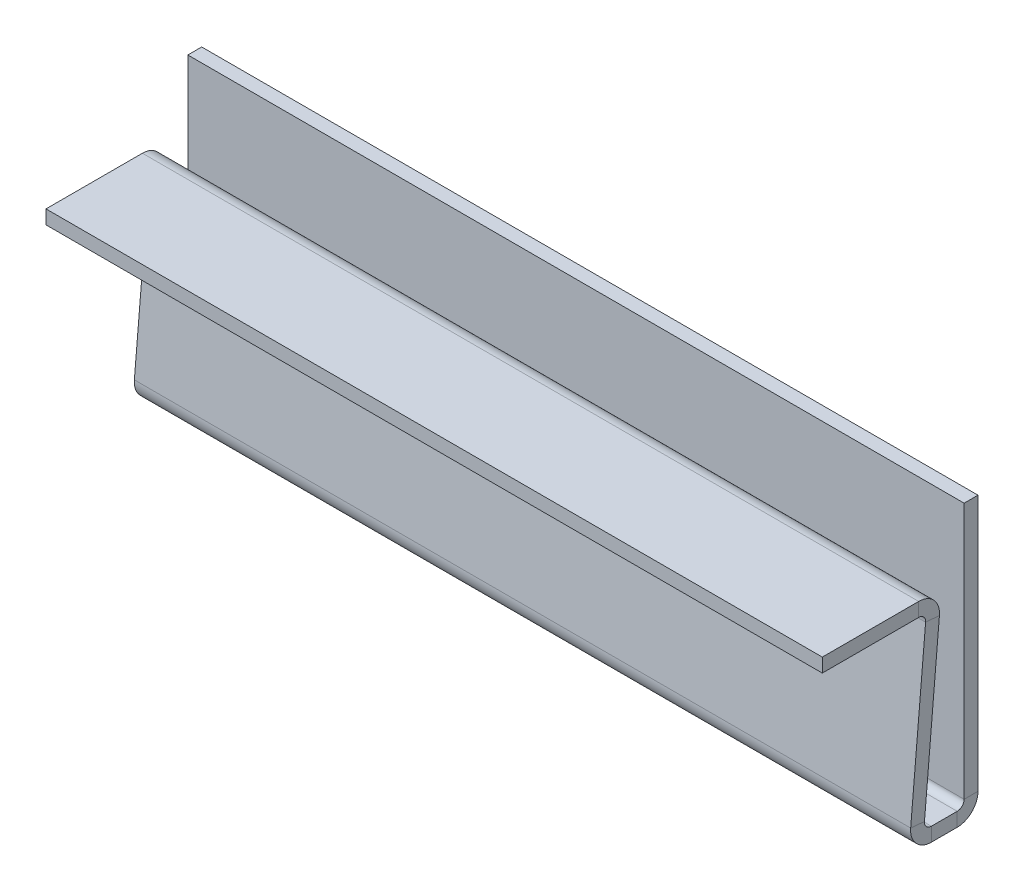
ISO-10303-21;
HEADER;
FILE_DESCRIPTION(('STEP AP214'),'2;1');
FILE_NAME('part.step','',(''),(''),'','','');
FILE_SCHEMA(('AUTOMOTIVE_DESIGN { 1 0 10303 214 1 1 1 1 }'));
ENDSEC;
DATA;
#1=APPLICATION_CONTEXT('core data for automotive mechanical design processes');
#2=APPLICATION_PROTOCOL_DEFINITION('international standard','automotive_design',2000,#1);
#3=PRODUCT_CONTEXT('',#1,'mechanical');
#4=PRODUCT('Part','Part','',(#3));
#5=PRODUCT_RELATED_PRODUCT_CATEGORY('part','',(#4));
#6=PRODUCT_DEFINITION_FORMATION('','',#4);
#7=PRODUCT_DEFINITION_CONTEXT('part definition',#1,'design');
#8=PRODUCT_DEFINITION('design','',#6,#7);
#9=PRODUCT_DEFINITION_SHAPE('','',#8);
#10=(LENGTH_UNIT() NAMED_UNIT(*) SI_UNIT(.MILLI.,.METRE.));
#11=(NAMED_UNIT(*) PLANE_ANGLE_UNIT() SI_UNIT($,.RADIAN.));
#12=(NAMED_UNIT(*) SI_UNIT($,.STERADIAN.) SOLID_ANGLE_UNIT());
#13=UNCERTAINTY_MEASURE_WITH_UNIT(LENGTH_MEASURE(1.E-05),#10,'distance_accuracy_value','');
#14=(GEOMETRIC_REPRESENTATION_CONTEXT(3) GLOBAL_UNCERTAINTY_ASSIGNED_CONTEXT((#13)) GLOBAL_UNIT_ASSIGNED_CONTEXT((#10,
#11,#12)) REPRESENTATION_CONTEXT('',''));
#15=CARTESIAN_POINT('',(0.,0.,0.));
#16=DIRECTION('',(0.,0.,1.));
#17=DIRECTION('',(1.,0.,0.));
#18=AXIS2_PLACEMENT_3D('',#15,#16,#17);
#19=CARTESIAN_POINT('',(56.,-40.,3.));
#20=DIRECTION('',(1.,0.,0.));
#21=DIRECTION('',(0.,0.,-1.));
#22=AXIS2_PLACEMENT_3D('',#19,#20,#21);
#23=PLANE('',#22);
#24=DIRECTION('',(0.,1.,0.));
#25=VECTOR('',#24,1.);
#26=CARTESIAN_POINT('',(56.,-40.,3.));
#27=LINE('',#26,#25);
#28=CARTESIAN_POINT('',(56.,-40.,3.));
#29=VERTEX_POINT('',#28);
#30=CARTESIAN_POINT('',(56.,-38.,3.));
#31=VERTEX_POINT('',#30);
#32=EDGE_CURVE('E11',#29,#31,#27,.T.);
#33=ORIENTED_EDGE('',*,*,#32,.F.);
#34=CARTESIAN_POINT('',(56.,-37.,3.));
#35=DIRECTION('',(1.,0.,0.));
#36=DIRECTION('',(0.,0.,-1.));
#37=AXIS2_PLACEMENT_3D('',#34,#35,#36);
#38=CIRCLE('',#37,3.);
#39=CARTESIAN_POINT('',(56.,-37.,0.));
#40=VERTEX_POINT('',#39);
#41=EDGE_CURVE('E307',#40,#29,#38,.F.);
#42=ORIENTED_EDGE('',*,*,#41,.F.);
#43=DIRECTION('',(0.,0.,-1.));
#44=VECTOR('',#43,1.);
#45=CARTESIAN_POINT('',(56.,-37.,2.));
#46=LINE('',#45,#44);
#47=CARTESIAN_POINT('',(56.,-37.,2.));
#48=VERTEX_POINT('',#47);
#49=EDGE_CURVE('E42',#48,#40,#46,.T.);
#50=ORIENTED_EDGE('',*,*,#49,.F.);
#51=CARTESIAN_POINT('',(56.,-37.,3.));
#52=DIRECTION('',(1.,0.,0.));
#53=DIRECTION('',(0.,0.,-1.));
#54=AXIS2_PLACEMENT_3D('',#51,#52,#53);
#55=CIRCLE('',#54,1.);
#56=EDGE_CURVE('E320',#48,#31,#55,.F.);
#57=ORIENTED_EDGE('',*,*,#56,.T.);
#58=EDGE_LOOP('',(#33,#42,#50,#57));
#59=FACE_BOUND('',#58,.T.);
#60=ADVANCED_FACE('F34',(#59),#23,.T.);
#61=CARTESIAN_POINT('',(56.,-37.,2.));
#62=DIRECTION('',(1.,0.,0.));
#63=DIRECTION('',(0.,0.,-1.));
#64=AXIS2_PLACEMENT_3D('',#61,#62,#63);
#65=PLANE('',#64);
#66=DIRECTION('',(0.,0.,1.));
#67=VECTOR('',#66,1.);
#68=CARTESIAN_POINT('',(56.,-40.,0.));
#69=LINE('',#68,#67);
#70=CARTESIAN_POINT('',(56.,-40.,6.72607449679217));
#71=VERTEX_POINT('',#70);
#72=EDGE_CURVE('E311',#29,#71,#69,.T.);
#73=ORIENTED_EDGE('',*,*,#72,.F.);
#74=ORIENTED_EDGE('',*,*,#32,.T.);
#75=DIRECTION('',(0.,0.,-1.));
#76=VECTOR('',#75,1.);
#77=CARTESIAN_POINT('',(56.,-38.,0.));
#78=LINE('',#77,#76);
#79=CARTESIAN_POINT('',(56.,-38.,6.72607449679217));
#80=VERTEX_POINT('',#79);
#81=EDGE_CURVE('E177',#31,#80,#78,.F.);
#82=ORIENTED_EDGE('',*,*,#81,.T.);
#83=DIRECTION('',(0.,-1.,0.));
#84=VECTOR('',#83,1.);
#85=CARTESIAN_POINT('',(56.,-38.,6.72607449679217));
#86=LINE('',#85,#84);
#87=EDGE_CURVE('E168',#80,#71,#86,.T.);
#88=ORIENTED_EDGE('',*,*,#87,.T.);
#89=EDGE_LOOP('',(#73,#74,#82,#88));
#90=FACE_BOUND('',#89,.T.);
#91=ADVANCED_FACE('F325',(#90),#65,.T.);
#92=CARTESIAN_POINT('',(-56.,-37.,0.));
#93=DIRECTION('',(-1.,0.,0.));
#94=DIRECTION('',(0.,0.,1.));
#95=AXIS2_PLACEMENT_3D('',#92,#93,#94);
#96=PLANE('',#95);
#97=DIRECTION('',(0.,0.,1.));
#98=VECTOR('',#97,1.);
#99=CARTESIAN_POINT('',(-56.,-37.,0.));
#100=LINE('',#99,#98);
#101=CARTESIAN_POINT('',(-56.,-37.,0.));
#102=VERTEX_POINT('',#101);
#103=CARTESIAN_POINT('',(-56.,-37.,2.));
#104=VERTEX_POINT('',#103);
#105=EDGE_CURVE('E287',#102,#104,#100,.T.);
#106=ORIENTED_EDGE('',*,*,#105,.F.);
#107=CARTESIAN_POINT('',(-56.,-37.,3.));
#108=DIRECTION('',(1.,0.,0.));
#109=DIRECTION('',(0.,0.,-1.));
#110=AXIS2_PLACEMENT_3D('',#107,#108,#109);
#111=CIRCLE('',#110,3.);
#112=CARTESIAN_POINT('',(-56.,-40.,3.));
#113=VERTEX_POINT('',#112);
#114=EDGE_CURVE('E217',#102,#113,#111,.F.);
#115=ORIENTED_EDGE('',*,*,#114,.T.);
#116=DIRECTION('',(0.,-1.,0.));
#117=VECTOR('',#116,1.);
#118=CARTESIAN_POINT('',(-56.,-38.,3.));
#119=LINE('',#118,#117);
#120=CARTESIAN_POINT('',(-56.,-38.,3.));
#121=VERTEX_POINT('',#120);
#122=EDGE_CURVE('E167',#121,#113,#119,.T.);
#123=ORIENTED_EDGE('',*,*,#122,.F.);
#124=CARTESIAN_POINT('',(-56.,-37.,3.));
#125=DIRECTION('',(1.,0.,0.));
#126=DIRECTION('',(0.,0.,-1.));
#127=AXIS2_PLACEMENT_3D('',#124,#125,#126);
#128=CIRCLE('',#127,1.);
#129=EDGE_CURVE('E229',#104,#121,#128,.F.);
#130=ORIENTED_EDGE('',*,*,#129,.F.);
#131=EDGE_LOOP('',(#106,#115,#123,#130));
#132=FACE_BOUND('',#131,.T.);
#133=ADVANCED_FACE('F377',(#132),#96,.T.);
#134=CARTESIAN_POINT('',(-56.,-38.,3.));
#135=DIRECTION('',(-1.,0.,0.));
#136=DIRECTION('',(0.,0.,1.));
#137=AXIS2_PLACEMENT_3D('',#134,#135,#136);
#138=PLANE('',#137);
#139=DIRECTION('',(0.,-1.,0.));
#140=VECTOR('',#139,1.);
#141=CARTESIAN_POINT('',(-56.,0.,0.));
#142=LINE('',#141,#140);
#143=CARTESIAN_POINT('',(-56.,0.,0.));
#144=VERTEX_POINT('',#143);
#145=EDGE_CURVE('E220',#144,#102,#142,.T.);
#146=ORIENTED_EDGE('',*,*,#145,.T.);
#147=ORIENTED_EDGE('',*,*,#105,.T.);
#148=DIRECTION('',(0.,-1.,0.));
#149=VECTOR('',#148,1.);
#150=CARTESIAN_POINT('',(-56.,0.,2.));
#151=LINE('',#150,#149);
#152=CARTESIAN_POINT('',(-56.,0.,2.));
#153=VERTEX_POINT('',#152);
#154=EDGE_CURVE('E226',#153,#104,#151,.T.);
#155=ORIENTED_EDGE('',*,*,#154,.F.);
#156=DIRECTION('',(0.,0.,-1.));
#157=VECTOR('',#156,1.);
#158=CARTESIAN_POINT('',(-56.,0.,2.));
#159=LINE('',#158,#157);
#160=EDGE_CURVE('E223',#153,#144,#159,.T.);
#161=ORIENTED_EDGE('',*,*,#160,.T.);
#162=EDGE_LOOP('',(#146,#147,#155,#161));
#163=FACE_BOUND('',#162,.T.);
#164=ADVANCED_FACE('F381',(#163),#138,.T.);
#165=CARTESIAN_POINT('',(56.,-36.738532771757,9.7146585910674));
#166=DIRECTION('',(1.,0.,0.));
#167=DIRECTION('',(0.,0.,-1.));
#168=AXIS2_PLACEMENT_3D('',#165,#166,#167);
#169=PLANE('',#168);
#170=DIRECTION('',(0.,-0.0871557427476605,-0.996194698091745));
#171=VECTOR('',#170,1.);
#172=CARTESIAN_POINT('',(56.,-36.738532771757,9.7146585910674));
#173=LINE('',#172,#171);
#174=CARTESIAN_POINT('',(56.,-36.738532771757,9.7146585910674));
#175=VERTEX_POINT('',#174);
#176=CARTESIAN_POINT('',(56.,-36.9128442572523,7.72226919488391));
#177=VERTEX_POINT('',#176);
#178=EDGE_CURVE('E155',#175,#177,#173,.T.);
#179=ORIENTED_EDGE('',*,*,#178,.F.);
#180=CARTESIAN_POINT('',(56.,-37.,6.72607449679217));
#181=DIRECTION('',(1.,0.,0.));
#182=DIRECTION('',(0.,0.,-1.));
#183=AXIS2_PLACEMENT_3D('',#180,#181,#182);
#184=CIRCLE('',#183,3.);
#185=EDGE_CURVE('E337',#71,#175,#184,.F.);
#186=ORIENTED_EDGE('',*,*,#185,.F.);
#187=ORIENTED_EDGE('',*,*,#87,.F.);
#188=CARTESIAN_POINT('',(56.,-37.,6.72607449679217));
#189=DIRECTION('',(1.,0.,0.));
#190=DIRECTION('',(0.,0.,-1.));
#191=AXIS2_PLACEMENT_3D('',#188,#189,#190);
#192=CIRCLE('',#191,1.);
#193=EDGE_CURVE('E171',#80,#177,#192,.F.);
#194=ORIENTED_EDGE('',*,*,#193,.T.);
#195=EDGE_LOOP('',(#179,#186,#187,#194));
#196=FACE_BOUND('',#195,.T.);
#197=ADVANCED_FACE('F173',(#196),#169,.T.);
#198=CARTESIAN_POINT('',(56.,-38.,6.72607449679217));
#199=DIRECTION('',(1.,0.,0.));
#200=DIRECTION('',(0.,0.,-1.));
#201=AXIS2_PLACEMENT_3D('',#198,#199,#200);
#202=PLANE('',#201);
#203=DIRECTION('',(0.,0.996194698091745,-0.0871557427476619));
#204=VECTOR('',#203,1.);
#205=CARTESIAN_POINT('',(56.,-40.,9.99999999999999));
#206=LINE('',#205,#204);
#207=CARTESIAN_POINT('',(56.,-12.0871557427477,7.55794256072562));
#208=VERTEX_POINT('',#207);
#209=EDGE_CURVE('E162',#175,#208,#206,.T.);
#210=ORIENTED_EDGE('',*,*,#209,.F.);
#211=ORIENTED_EDGE('',*,*,#178,.T.);
#212=DIRECTION('',(0.,0.996194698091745,-0.0871557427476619));
#213=VECTOR('',#212,1.);
#214=CARTESIAN_POINT('',(56.,-40.1743114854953,8.00761060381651));
#215=LINE('',#214,#213);
#216=CARTESIAN_POINT('',(56.,-12.261467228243,5.56555316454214));
#217=VERTEX_POINT('',#216);
#218=EDGE_CURVE('E159',#177,#217,#215,.T.);
#219=ORIENTED_EDGE('',*,*,#218,.T.);
#220=DIRECTION('',(0.,0.0871557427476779,0.996194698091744));
#221=VECTOR('',#220,1.);
#222=CARTESIAN_POINT('',(56.,-12.261467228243,5.56555316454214));
#223=LINE('',#222,#221);
#224=EDGE_CURVE('E278',#217,#208,#223,.T.);
#225=ORIENTED_EDGE('',*,*,#224,.T.);
#226=EDGE_LOOP('',(#210,#211,#219,#225));
#227=FACE_BOUND('',#226,.T.);
#228=ADVANCED_FACE('F157',(#227),#202,.T.);
#229=CARTESIAN_POINT('',(-56.,-40.,6.72607449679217));
#230=DIRECTION('',(-1.,0.,0.));
#231=DIRECTION('',(0.,0.,1.));
#232=AXIS2_PLACEMENT_3D('',#229,#230,#231);
#233=PLANE('',#232);
#234=DIRECTION('',(0.,1.,0.));
#235=VECTOR('',#234,1.);
#236=CARTESIAN_POINT('',(-56.,-40.,6.72607449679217));
#237=LINE('',#236,#235);
#238=CARTESIAN_POINT('',(-56.,-40.,6.72607449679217));
#239=VERTEX_POINT('',#238);
#240=CARTESIAN_POINT('',(-56.,-38.,6.72607449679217));
#241=VERTEX_POINT('',#240);
#242=EDGE_CURVE('E283',#239,#241,#237,.T.);
#243=ORIENTED_EDGE('',*,*,#242,.F.);
#244=CARTESIAN_POINT('',(-56.,-37.,6.72607449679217));
#245=DIRECTION('',(1.,0.,0.));
#246=DIRECTION('',(0.,0.,-1.));
#247=AXIS2_PLACEMENT_3D('',#244,#245,#246);
#248=CIRCLE('',#247,3.);
#249=CARTESIAN_POINT('',(-56.,-36.738532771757,9.7146585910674));
#250=VERTEX_POINT('',#249);
#251=EDGE_CURVE('E211',#239,#250,#248,.F.);
#252=ORIENTED_EDGE('',*,*,#251,.T.);
#253=DIRECTION('',(0.,0.0871557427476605,0.996194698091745));
#254=VECTOR('',#253,1.);
#255=CARTESIAN_POINT('',(-56.,-36.9128442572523,7.72226919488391));
#256=LINE('',#255,#254);
#257=CARTESIAN_POINT('',(-56.,-36.9128442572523,7.72226919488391));
#258=VERTEX_POINT('',#257);
#259=EDGE_CURVE('E281',#258,#250,#256,.T.);
#260=ORIENTED_EDGE('',*,*,#259,.F.);
#261=CARTESIAN_POINT('',(-56.,-37.,6.72607449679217));
#262=DIRECTION('',(1.,0.,0.));
#263=DIRECTION('',(0.,0.,-1.));
#264=AXIS2_PLACEMENT_3D('',#261,#262,#263);
#265=CIRCLE('',#264,1.);
#266=EDGE_CURVE('E184',#241,#258,#265,.F.);
#267=ORIENTED_EDGE('',*,*,#266,.F.);
#268=EDGE_LOOP('',(#243,#252,#260,#267));
#269=FACE_BOUND('',#268,.T.);
#270=ADVANCED_FACE('F331',(#269),#233,.T.);
#271=CARTESIAN_POINT('',(-56.,-36.9128442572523,7.72226919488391));
#272=DIRECTION('',(-1.,0.,0.));
#273=DIRECTION('',(0.,0.,1.));
#274=AXIS2_PLACEMENT_3D('',#271,#272,#273);
#275=PLANE('',#274);
#276=DIRECTION('',(0.,0.,1.));
#277=VECTOR('',#276,1.);
#278=CARTESIAN_POINT('',(-56.,-40.,0.));
#279=LINE('',#278,#277);
#280=EDGE_CURVE('E214',#113,#239,#279,.T.);
#281=ORIENTED_EDGE('',*,*,#280,.T.);
#282=ORIENTED_EDGE('',*,*,#242,.T.);
#283=DIRECTION('',(0.,0.,-1.));
#284=VECTOR('',#283,1.);
#285=CARTESIAN_POINT('',(-56.,-38.,0.));
#286=LINE('',#285,#284);
#287=EDGE_CURVE('E232',#121,#241,#286,.F.);
#288=ORIENTED_EDGE('',*,*,#287,.F.);
#289=ORIENTED_EDGE('',*,*,#122,.T.);
#290=EDGE_LOOP('',(#281,#282,#288,#289));
#291=FACE_BOUND('',#290,.T.);
#292=ADVANCED_FACE('F389',(#291),#275,.T.);
#293=CARTESIAN_POINT('',(56.,-11.,8.55413725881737));
#294=DIRECTION('',(1.,0.,0.));
#295=DIRECTION('',(0.,0.,-1.));
#296=AXIS2_PLACEMENT_3D('',#293,#294,#295);
#297=PLANE('',#296);
#298=DIRECTION('',(0.,1.,0.));
#299=VECTOR('',#298,1.);
#300=CARTESIAN_POINT('',(56.,-11.,8.55413725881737));
#301=LINE('',#300,#299);
#302=CARTESIAN_POINT('',(56.,-11.,8.55413725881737));
#303=VERTEX_POINT('',#302);
#304=CARTESIAN_POINT('',(56.,-9.,8.55413725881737));
#305=VERTEX_POINT('',#304);
#306=EDGE_CURVE('E50',#303,#305,#301,.T.);
#307=ORIENTED_EDGE('',*,*,#306,.F.);
#308=CARTESIAN_POINT('',(56.,-12.,8.55413725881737));
#309=DIRECTION('',(-1.,0.,0.));
#310=DIRECTION('',(0.,0.,1.));
#311=AXIS2_PLACEMENT_3D('',#308,#309,#310);
#312=CIRCLE('',#311,1.);
#313=EDGE_CURVE('E365',#208,#303,#312,.F.);
#314=ORIENTED_EDGE('',*,*,#313,.F.);
#315=ORIENTED_EDGE('',*,*,#224,.F.);
#316=CARTESIAN_POINT('',(56.,-12.,8.55413725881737));
#317=DIRECTION('',(1.,0.,0.));
#318=DIRECTION('',(0.,0.,-1.));
#319=AXIS2_PLACEMENT_3D('',#316,#317,#318);
#320=CIRCLE('',#319,3.);
#321=EDGE_CURVE('E192',#217,#305,#320,.T.);
#322=ORIENTED_EDGE('',*,*,#321,.T.);
#323=EDGE_LOOP('',(#307,#314,#315,#322));
#324=FACE_BOUND('',#323,.T.);
#325=ADVANCED_FACE('F391',(#324),#297,.T.);
#326=CARTESIAN_POINT('',(56.,-12.261467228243,5.56555316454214));
#327=DIRECTION('',(1.,0.,0.));
#328=DIRECTION('',(0.,0.,-1.));
#329=AXIS2_PLACEMENT_3D('',#326,#327,#328);
#330=PLANE('',#329);
#331=DIRECTION('',(0.,0.,1.));
#332=VECTOR('',#331,1.);
#333=CARTESIAN_POINT('',(56.,-11.,7.46282875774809));
#334=LINE('',#333,#332);
#335=CARTESIAN_POINT('',(56.,-11.,22.4628287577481));
#336=VERTEX_POINT('',#335);
#337=EDGE_CURVE('E363',#303,#336,#334,.T.);
#338=ORIENTED_EDGE('',*,*,#337,.F.);
#339=ORIENTED_EDGE('',*,*,#306,.T.);
#340=DIRECTION('',(0.,0.,-1.));
#341=VECTOR('',#340,1.);
#342=CARTESIAN_POINT('',(56.,-9.,7.46282875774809));
#343=LINE('',#342,#341);
#344=CARTESIAN_POINT('',(56.,-9.,22.4628287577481));
#345=VERTEX_POINT('',#344);
#346=EDGE_CURVE('E116',#305,#345,#343,.F.);
#347=ORIENTED_EDGE('',*,*,#346,.T.);
#348=DIRECTION('',(0.,1.,0.));
#349=VECTOR('',#348,1.);
#350=CARTESIAN_POINT('',(56.,-11.,22.4628287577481));
#351=LINE('',#350,#349);
#352=EDGE_CURVE('E361',#336,#345,#351,.T.);
#353=ORIENTED_EDGE('',*,*,#352,.F.);
#354=EDGE_LOOP('',(#338,#339,#347,#353));
#355=FACE_BOUND('',#354,.T.);
#356=ADVANCED_FACE('F397',(#355),#330,.T.);
#357=CARTESIAN_POINT('',(-56.,-12.0871557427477,7.55794256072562));
#358=DIRECTION('',(-1.,0.,0.));
#359=DIRECTION('',(0.,0.,1.));
#360=AXIS2_PLACEMENT_3D('',#357,#358,#359);
#361=PLANE('',#360);
#362=DIRECTION('',(0.,-0.0871557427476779,-0.996194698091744));
#363=VECTOR('',#362,1.);
#364=CARTESIAN_POINT('',(-56.,-12.0871557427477,7.55794256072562));
#365=LINE('',#364,#363);
#366=CARTESIAN_POINT('',(-56.,-12.0871557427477,7.55794256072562));
#367=VERTEX_POINT('',#366);
#368=CARTESIAN_POINT('',(-56.,-12.261467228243,5.56555316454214));
#369=VERTEX_POINT('',#368);
#370=EDGE_CURVE('E103',#367,#369,#365,.T.);
#371=ORIENTED_EDGE('',*,*,#370,.F.);
#372=CARTESIAN_POINT('',(-56.,-12.,8.55413725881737));
#373=DIRECTION('',(-1.,0.,0.));
#374=DIRECTION('',(0.,0.,1.));
#375=AXIS2_PLACEMENT_3D('',#372,#373,#374);
#376=CIRCLE('',#375,1.);
#377=CARTESIAN_POINT('',(-56.,-11.,8.55413725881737));
#378=VERTEX_POINT('',#377);
#379=EDGE_CURVE('E207',#367,#378,#376,.F.);
#380=ORIENTED_EDGE('',*,*,#379,.T.);
#381=DIRECTION('',(0.,-1.,0.));
#382=VECTOR('',#381,1.);
#383=CARTESIAN_POINT('',(-56.,-9.,8.55413725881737));
#384=LINE('',#383,#382);
#385=CARTESIAN_POINT('',(-56.,-9.,8.55413725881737));
#386=VERTEX_POINT('',#385);
#387=EDGE_CURVE('E110',#386,#378,#384,.T.);
#388=ORIENTED_EDGE('',*,*,#387,.F.);
#389=CARTESIAN_POINT('',(-56.,-12.,8.55413725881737));
#390=DIRECTION('',(1.,0.,0.));
#391=DIRECTION('',(0.,0.,-1.));
#392=AXIS2_PLACEMENT_3D('',#389,#390,#391);
#393=CIRCLE('',#392,3.);
#394=EDGE_CURVE('E238',#369,#386,#393,.T.);
#395=ORIENTED_EDGE('',*,*,#394,.F.);
#396=EDGE_LOOP('',(#371,#380,#388,#395));
#397=FACE_BOUND('',#396,.T.);
#398=ADVANCED_FACE('F348',(#397),#361,.T.);
#399=CARTESIAN_POINT('',(-56.,-9.,8.55413725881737));
#400=DIRECTION('',(-1.,0.,0.));
#401=DIRECTION('',(0.,0.,1.));
#402=AXIS2_PLACEMENT_3D('',#399,#400,#401);
#403=PLANE('',#402);
#404=DIRECTION('',(0.,0.996194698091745,-0.0871557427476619));
#405=VECTOR('',#404,1.);
#406=CARTESIAN_POINT('',(-56.,-40.,9.99999999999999));
#407=LINE('',#406,#405);
#408=EDGE_CURVE('E209',#250,#367,#407,.T.);
#409=ORIENTED_EDGE('',*,*,#408,.T.);
#410=ORIENTED_EDGE('',*,*,#370,.T.);
#411=DIRECTION('',(0.,0.996194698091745,-0.0871557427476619));
#412=VECTOR('',#411,1.);
#413=CARTESIAN_POINT('',(-56.,-40.1743114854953,8.00761060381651));
#414=LINE('',#413,#412);
#415=EDGE_CURVE('E236',#258,#369,#414,.T.);
#416=ORIENTED_EDGE('',*,*,#415,.F.);
#417=ORIENTED_EDGE('',*,*,#259,.T.);
#418=EDGE_LOOP('',(#409,#410,#416,#417));
#419=FACE_BOUND('',#418,.T.);
#420=ADVANCED_FACE('F333',(#419),#403,.T.);
#421=CARTESIAN_POINT('',(56.,-9.,7.46282875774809));
#422=DIRECTION('',(0.,-1.,0.));
#423=DIRECTION('',(0.,0.,-1.));
#424=AXIS2_PLACEMENT_3D('',#421,#422,#423);
#425=PLANE('',#424);
#426=DIRECTION('',(0.,0.,-1.));
#427=VECTOR('',#426,1.);
#428=CARTESIAN_POINT('',(-56.,-9.,7.46282875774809));
#429=LINE('',#428,#427);
#430=CARTESIAN_POINT('',(-56.,-9.,22.4628287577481));
#431=VERTEX_POINT('',#430);
#432=EDGE_CURVE('E198',#386,#431,#429,.F.);
#433=ORIENTED_EDGE('',*,*,#432,.T.);
#434=DIRECTION('',(-1.,0.,0.));
#435=VECTOR('',#434,1.);
#436=CARTESIAN_POINT('',(56.,-9.,22.4628287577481));
#437=LINE('',#436,#435);
#438=EDGE_CURVE('E274',#345,#431,#437,.T.);
#439=ORIENTED_EDGE('',*,*,#438,.F.);
#440=ORIENTED_EDGE('',*,*,#346,.F.);
#441=DIRECTION('',(-1.,0.,0.));
#442=VECTOR('',#441,1.);
#443=CARTESIAN_POINT('',(56.,-9.,8.55413725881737));
#444=LINE('',#443,#442);
#445=EDGE_CURVE('E194',#305,#386,#444,.T.);
#446=ORIENTED_EDGE('',*,*,#445,.T.);
#447=EDGE_LOOP('',(#433,#439,#440,#446));
#448=FACE_BOUND('',#447,.T.);
#449=ADVANCED_FACE('F354',(#448),#425,.F.);
#450=CARTESIAN_POINT('',(56.,-11.,22.4628287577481));
#451=DIRECTION('',(0.,0.,1.));
#452=DIRECTION('',(1.,0.,0.));
#453=AXIS2_PLACEMENT_3D('',#450,#451,#452);
#454=PLANE('',#453);
#455=DIRECTION('',(0.,1.,0.));
#456=VECTOR('',#455,1.);
#457=CARTESIAN_POINT('',(-56.,-11.,22.4628287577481));
#458=LINE('',#457,#456);
#459=CARTESIAN_POINT('',(-56.,-11.,22.4628287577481));
#460=VERTEX_POINT('',#459);
#461=EDGE_CURVE('E201',#460,#431,#458,.T.);
#462=ORIENTED_EDGE('',*,*,#461,.F.);
#463=DIRECTION('',(-1.,0.,0.));
#464=VECTOR('',#463,1.);
#465=CARTESIAN_POINT('',(56.,-11.,22.4628287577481));
#466=LINE('',#465,#464);
#467=EDGE_CURVE('E272',#336,#460,#466,.T.);
#468=ORIENTED_EDGE('',*,*,#467,.F.);
#469=ORIENTED_EDGE('',*,*,#352,.T.);
#470=ORIENTED_EDGE('',*,*,#438,.T.);
#471=EDGE_LOOP('',(#462,#468,#469,#470));
#472=FACE_BOUND('',#471,.T.);
#473=ADVANCED_FACE('F359',(#472),#454,.T.);
#474=CARTESIAN_POINT('',(56.,-11.,7.46282875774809));
#475=DIRECTION('',(0.,-1.,0.));
#476=DIRECTION('',(0.,0.,-1.));
#477=AXIS2_PLACEMENT_3D('',#474,#475,#476);
#478=PLANE('',#477);
#479=DIRECTION('',(0.,0.,1.));
#480=VECTOR('',#479,1.);
#481=CARTESIAN_POINT('',(-56.,-11.,7.46282875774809));
#482=LINE('',#481,#480);
#483=EDGE_CURVE('E204',#378,#460,#482,.T.);
#484=ORIENTED_EDGE('',*,*,#483,.F.);
#485=DIRECTION('',(-1.,0.,0.));
#486=VECTOR('',#485,1.);
#487=CARTESIAN_POINT('',(56.,-11.,8.55413725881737));
#488=LINE('',#487,#486);
#489=EDGE_CURVE('E269',#303,#378,#488,.T.);
#490=ORIENTED_EDGE('',*,*,#489,.F.);
#491=ORIENTED_EDGE('',*,*,#337,.T.);
#492=ORIENTED_EDGE('',*,*,#467,.T.);
#493=EDGE_LOOP('',(#484,#490,#491,#492));
#494=FACE_BOUND('',#493,.T.);
#495=ADVANCED_FACE('F481',(#494),#478,.T.);
#496=CARTESIAN_POINT('',(56.,-12.,8.55413725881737));
#497=DIRECTION('',(-1.,0.,0.));
#498=DIRECTION('',(0.,0.,1.));
#499=AXIS2_PLACEMENT_3D('',#496,#497,#498);
#500=CYLINDRICAL_SURFACE('',#499,1.);
#501=ORIENTED_EDGE('',*,*,#379,.F.);
#502=DIRECTION('',(-1.,0.,0.));
#503=VECTOR('',#502,1.);
#504=CARTESIAN_POINT('',(56.,-12.0871557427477,7.55794256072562));
#505=LINE('',#504,#503);
#506=EDGE_CURVE('E266',#208,#367,#505,.T.);
#507=ORIENTED_EDGE('',*,*,#506,.F.);
#508=ORIENTED_EDGE('',*,*,#313,.T.);
#509=ORIENTED_EDGE('',*,*,#489,.T.);
#510=EDGE_LOOP('',(#501,#507,#508,#509));
#511=FACE_BOUND('',#510,.T.);
#512=ADVANCED_FACE('F345',(#511),#500,.F.);
#513=CARTESIAN_POINT('',(56.,-40.,9.99999999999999));
#514=DIRECTION('',(0.,0.0871557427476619,0.996194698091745));
#515=DIRECTION('',(0.,-0.996194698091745,0.0871557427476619));
#516=AXIS2_PLACEMENT_3D('',#513,#514,#515);
#517=PLANE('',#516);
#518=ORIENTED_EDGE('',*,*,#408,.F.);
#519=DIRECTION('',(-1.,0.,0.));
#520=VECTOR('',#519,1.);
#521=CARTESIAN_POINT('',(56.,-36.738532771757,9.7146585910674));
#522=LINE('',#521,#520);
#523=EDGE_CURVE('E263',#175,#250,#522,.T.);
#524=ORIENTED_EDGE('',*,*,#523,.F.);
#525=ORIENTED_EDGE('',*,*,#209,.T.);
#526=ORIENTED_EDGE('',*,*,#506,.T.);
#527=EDGE_LOOP('',(#518,#524,#525,#526));
#528=FACE_BOUND('',#527,.T.);
#529=ADVANCED_FACE('F339',(#528),#517,.T.);
#530=CARTESIAN_POINT('',(56.,-37.,6.72607449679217));
#531=DIRECTION('',(-1.,0.,0.));
#532=DIRECTION('',(0.,0.,1.));
#533=AXIS2_PLACEMENT_3D('',#530,#531,#532);
#534=CYLINDRICAL_SURFACE('',#533,3.);
#535=ORIENTED_EDGE('',*,*,#251,.F.);
#536=DIRECTION('',(-1.,0.,0.));
#537=VECTOR('',#536,1.);
#538=CARTESIAN_POINT('',(56.,-40.,6.72607449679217));
#539=LINE('',#538,#537);
#540=EDGE_CURVE('E260',#71,#239,#539,.T.);
#541=ORIENTED_EDGE('',*,*,#540,.F.);
#542=ORIENTED_EDGE('',*,*,#185,.T.);
#543=ORIENTED_EDGE('',*,*,#523,.T.);
#544=EDGE_LOOP('',(#535,#541,#542,#543));
#545=FACE_BOUND('',#544,.T.);
#546=ADVANCED_FACE('F336',(#545),#534,.T.);
#547=CARTESIAN_POINT('',(56.,-40.,0.));
#548=DIRECTION('',(0.,-1.,0.));
#549=DIRECTION('',(0.,0.,-1.));
#550=AXIS2_PLACEMENT_3D('',#547,#548,#549);
#551=PLANE('',#550);
#552=ORIENTED_EDGE('',*,*,#280,.F.);
#553=DIRECTION('',(-1.,0.,0.));
#554=VECTOR('',#553,1.);
#555=CARTESIAN_POINT('',(56.,-40.,3.));
#556=LINE('',#555,#554);
#557=EDGE_CURVE('E257',#29,#113,#556,.T.);
#558=ORIENTED_EDGE('',*,*,#557,.F.);
#559=ORIENTED_EDGE('',*,*,#72,.T.);
#560=ORIENTED_EDGE('',*,*,#540,.T.);
#561=EDGE_LOOP('',(#552,#558,#559,#560));
#562=FACE_BOUND('',#561,.T.);
#563=ADVANCED_FACE('F374',(#562),#551,.T.);
#564=CARTESIAN_POINT('',(56.,-37.,3.));
#565=DIRECTION('',(-1.,0.,0.));
#566=DIRECTION('',(0.,0.,1.));
#567=AXIS2_PLACEMENT_3D('',#564,#565,#566);
#568=CYLINDRICAL_SURFACE('',#567,3.);
#569=ORIENTED_EDGE('',*,*,#114,.F.);
#570=DIRECTION('',(-1.,0.,0.));
#571=VECTOR('',#570,1.);
#572=CARTESIAN_POINT('',(56.,-37.,0.));
#573=LINE('',#572,#571);
#574=EDGE_CURVE('E254',#40,#102,#573,.T.);
#575=ORIENTED_EDGE('',*,*,#574,.F.);
#576=ORIENTED_EDGE('',*,*,#41,.T.);
#577=ORIENTED_EDGE('',*,*,#557,.T.);
#578=EDGE_LOOP('',(#569,#575,#576,#577));
#579=FACE_BOUND('',#578,.T.);
#580=ADVANCED_FACE('F306',(#579),#568,.T.);
#581=CARTESIAN_POINT('',(56.,0.,0.));
#582=DIRECTION('',(0.,0.,-1.));
#583=DIRECTION('',(0.,1.,0.));
#584=AXIS2_PLACEMENT_3D('',#581,#582,#583);
#585=PLANE('',#584);
#586=ORIENTED_EDGE('',*,*,#145,.F.);
#587=DIRECTION('',(-1.,0.,0.));
#588=VECTOR('',#587,1.);
#589=CARTESIAN_POINT('',(56.,0.,0.));
#590=LINE('',#589,#588);
#591=CARTESIAN_POINT('',(56.,0.,0.));
#592=VERTEX_POINT('',#591);
#593=EDGE_CURVE('E252',#592,#144,#590,.T.);
#594=ORIENTED_EDGE('',*,*,#593,.F.);
#595=DIRECTION('',(0.,-1.,0.));
#596=VECTOR('',#595,1.);
#597=CARTESIAN_POINT('',(56.,0.,0.));
#598=LINE('',#597,#596);
#599=EDGE_CURVE('E295',#592,#40,#598,.T.);
#600=ORIENTED_EDGE('',*,*,#599,.T.);
#601=ORIENTED_EDGE('',*,*,#574,.T.);
#602=EDGE_LOOP('',(#586,#594,#600,#601));
#603=FACE_BOUND('',#602,.T.);
#604=ADVANCED_FACE('F313',(#603),#585,.T.);
#605=CARTESIAN_POINT('',(56.,0.,2.));
#606=DIRECTION('',(0.,1.,0.));
#607=DIRECTION('',(0.,0.,1.));
#608=AXIS2_PLACEMENT_3D('',#605,#606,#607);
#609=PLANE('',#608);
#610=ORIENTED_EDGE('',*,*,#160,.F.);
#611=DIRECTION('',(-1.,0.,0.));
#612=VECTOR('',#611,1.);
#613=CARTESIAN_POINT('',(56.,0.,2.));
#614=LINE('',#613,#612);
#615=CARTESIAN_POINT('',(56.,0.,2.));
#616=VERTEX_POINT('',#615);
#617=EDGE_CURVE('E250',#616,#153,#614,.T.);
#618=ORIENTED_EDGE('',*,*,#617,.F.);
#619=DIRECTION('',(0.,0.,-1.));
#620=VECTOR('',#619,1.);
#621=CARTESIAN_POINT('',(56.,0.,2.));
#622=LINE('',#621,#620);
#623=EDGE_CURVE('E314',#616,#592,#622,.T.);
#624=ORIENTED_EDGE('',*,*,#623,.T.);
#625=ORIENTED_EDGE('',*,*,#593,.T.);
#626=EDGE_LOOP('',(#610,#618,#624,#625));
#627=FACE_BOUND('',#626,.T.);
#628=ADVANCED_FACE('F546',(#627),#609,.T.);
#629=CARTESIAN_POINT('',(56.,0.,2.));
#630=DIRECTION('',(0.,0.,-1.));
#631=DIRECTION('',(0.,1.,0.));
#632=AXIS2_PLACEMENT_3D('',#629,#630,#631);
#633=PLANE('',#632);
#634=ORIENTED_EDGE('',*,*,#154,.T.);
#635=DIRECTION('',(-1.,0.,0.));
#636=VECTOR('',#635,1.);
#637=CARTESIAN_POINT('',(56.,-37.,2.));
#638=LINE('',#637,#636);
#639=EDGE_CURVE('E247',#48,#104,#638,.T.);
#640=ORIENTED_EDGE('',*,*,#639,.F.);
#641=DIRECTION('',(0.,-1.,0.));
#642=VECTOR('',#641,1.);
#643=CARTESIAN_POINT('',(56.,0.,2.));
#644=LINE('',#643,#642);
#645=EDGE_CURVE('E298',#616,#48,#644,.T.);
#646=ORIENTED_EDGE('',*,*,#645,.F.);
#647=ORIENTED_EDGE('',*,*,#617,.T.);
#648=EDGE_LOOP('',(#634,#640,#646,#647));
#649=FACE_BOUND('',#648,.T.);
#650=ADVANCED_FACE('F384',(#649),#633,.F.);
#651=CARTESIAN_POINT('',(56.,-37.,3.));
#652=DIRECTION('',(-1.,0.,0.));
#653=DIRECTION('',(0.,0.,1.));
#654=AXIS2_PLACEMENT_3D('',#651,#652,#653);
#655=CYLINDRICAL_SURFACE('',#654,1.);
#656=ORIENTED_EDGE('',*,*,#129,.T.);
#657=DIRECTION('',(-1.,0.,0.));
#658=VECTOR('',#657,1.);
#659=CARTESIAN_POINT('',(56.,-38.,3.));
#660=LINE('',#659,#658);
#661=EDGE_CURVE('E244',#31,#121,#660,.T.);
#662=ORIENTED_EDGE('',*,*,#661,.F.);
#663=ORIENTED_EDGE('',*,*,#56,.F.);
#664=ORIENTED_EDGE('',*,*,#639,.T.);
#665=EDGE_LOOP('',(#656,#662,#663,#664));
#666=FACE_BOUND('',#665,.T.);
#667=ADVANCED_FACE('F387',(#666),#655,.F.);
#668=CARTESIAN_POINT('',(56.,-38.,0.));
#669=DIRECTION('',(0.,-1.,0.));
#670=DIRECTION('',(0.,0.,-1.));
#671=AXIS2_PLACEMENT_3D('',#668,#669,#670);
#672=PLANE('',#671);
#673=ORIENTED_EDGE('',*,*,#287,.T.);
#674=DIRECTION('',(-1.,0.,0.));
#675=VECTOR('',#674,1.);
#676=CARTESIAN_POINT('',(56.,-38.,6.72607449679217));
#677=LINE('',#676,#675);
#678=EDGE_CURVE('E186',#80,#241,#677,.T.);
#679=ORIENTED_EDGE('',*,*,#678,.F.);
#680=ORIENTED_EDGE('',*,*,#81,.F.);
#681=ORIENTED_EDGE('',*,*,#661,.T.);
#682=EDGE_LOOP('',(#673,#679,#680,#681));
#683=FACE_BOUND('',#682,.T.);
#684=ADVANCED_FACE('F328',(#683),#672,.F.);
#685=CARTESIAN_POINT('',(56.,-37.,6.72607449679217));
#686=DIRECTION('',(-1.,0.,0.));
#687=DIRECTION('',(0.,0.,1.));
#688=AXIS2_PLACEMENT_3D('',#685,#686,#687);
#689=CYLINDRICAL_SURFACE('',#688,1.);
#690=ORIENTED_EDGE('',*,*,#266,.T.);
#691=DIRECTION('',(-1.,0.,0.));
#692=VECTOR('',#691,1.);
#693=CARTESIAN_POINT('',(56.,-36.9128442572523,7.72226919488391));
#694=LINE('',#693,#692);
#695=EDGE_CURVE('E181',#177,#258,#694,.T.);
#696=ORIENTED_EDGE('',*,*,#695,.F.);
#697=ORIENTED_EDGE('',*,*,#193,.F.);
#698=ORIENTED_EDGE('',*,*,#678,.T.);
#699=EDGE_LOOP('',(#690,#696,#697,#698));
#700=FACE_BOUND('',#699,.T.);
#701=ADVANCED_FACE('F182',(#700),#689,.F.);
#702=CARTESIAN_POINT('',(56.,-40.1743114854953,8.00761060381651));
#703=DIRECTION('',(0.,0.0871557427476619,0.996194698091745));
#704=DIRECTION('',(0.,-0.996194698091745,0.0871557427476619));
#705=AXIS2_PLACEMENT_3D('',#702,#703,#704);
#706=PLANE('',#705);
#707=ORIENTED_EDGE('',*,*,#415,.T.);
#708=DIRECTION('',(-1.,0.,0.));
#709=VECTOR('',#708,1.);
#710=CARTESIAN_POINT('',(56.,-12.261467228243,5.56555316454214));
#711=LINE('',#710,#709);
#712=EDGE_CURVE('E187',#217,#369,#711,.T.);
#713=ORIENTED_EDGE('',*,*,#712,.F.);
#714=ORIENTED_EDGE('',*,*,#218,.F.);
#715=ORIENTED_EDGE('',*,*,#695,.T.);
#716=EDGE_LOOP('',(#707,#713,#714,#715));
#717=FACE_BOUND('',#716,.T.);
#718=ADVANCED_FACE('F189',(#717),#706,.F.);
#719=CARTESIAN_POINT('',(56.,-12.,8.55413725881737));
#720=DIRECTION('',(-1.,0.,0.));
#721=DIRECTION('',(0.,0.,1.));
#722=AXIS2_PLACEMENT_3D('',#719,#720,#721);
#723=CYLINDRICAL_SURFACE('',#722,3.);
#724=ORIENTED_EDGE('',*,*,#394,.T.);
#725=ORIENTED_EDGE('',*,*,#445,.F.);
#726=ORIENTED_EDGE('',*,*,#321,.F.);
#727=ORIENTED_EDGE('',*,*,#712,.T.);
#728=EDGE_LOOP('',(#724,#725,#726,#727));
#729=FACE_BOUND('',#728,.T.);
#730=ADVANCED_FACE('F351',(#729),#723,.T.);
#731=CARTESIAN_POINT('',(56.,-12.,8.55413725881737));
#732=DIRECTION('',(-1.,0.,0.));
#733=DIRECTION('',(0.,0.,1.));
#734=AXIS2_PLACEMENT_3D('',#731,#732,#733);
#735=PLANE('',#734);
#736=ORIENTED_EDGE('',*,*,#645,.T.);
#737=ORIENTED_EDGE('',*,*,#49,.T.);
#738=ORIENTED_EDGE('',*,*,#599,.F.);
#739=ORIENTED_EDGE('',*,*,#623,.F.);
#740=EDGE_LOOP('',(#736,#737,#738,#739));
#741=FACE_BOUND('',#740,.T.);
#742=ADVANCED_FACE('F292',(#741),#735,.F.);
#743=CARTESIAN_POINT('',(-56.,-12.,8.55413725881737));
#744=DIRECTION('',(-1.,0.,0.));
#745=DIRECTION('',(0.,0.,1.));
#746=AXIS2_PLACEMENT_3D('',#743,#744,#745);
#747=PLANE('',#746);
#748=ORIENTED_EDGE('',*,*,#432,.F.);
#749=ORIENTED_EDGE('',*,*,#387,.T.);
#750=ORIENTED_EDGE('',*,*,#483,.T.);
#751=ORIENTED_EDGE('',*,*,#461,.T.);
#752=EDGE_LOOP('',(#748,#749,#750,#751));
#753=FACE_BOUND('',#752,.T.);
#754=ADVANCED_FACE('F356',(#753),#747,.T.);
#755=CLOSED_SHELL('',(#60,#91,#133,#164,#197,#228,#270,#292,#325,#356,#398,#420,#449,#473,#495,
#512,#529,#546,#563,#580,#604,#628,#650,#667,#684,#701,#718,#730,#742,#754));
#756=MANIFOLD_SOLID_BREP('B2',#755);
#757=ADVANCED_BREP_SHAPE_REPRESENTATION('',(#18,#756),#14);
#758=SHAPE_DEFINITION_REPRESENTATION(#9,#757);
ENDSEC;
END-ISO-10303-21;
